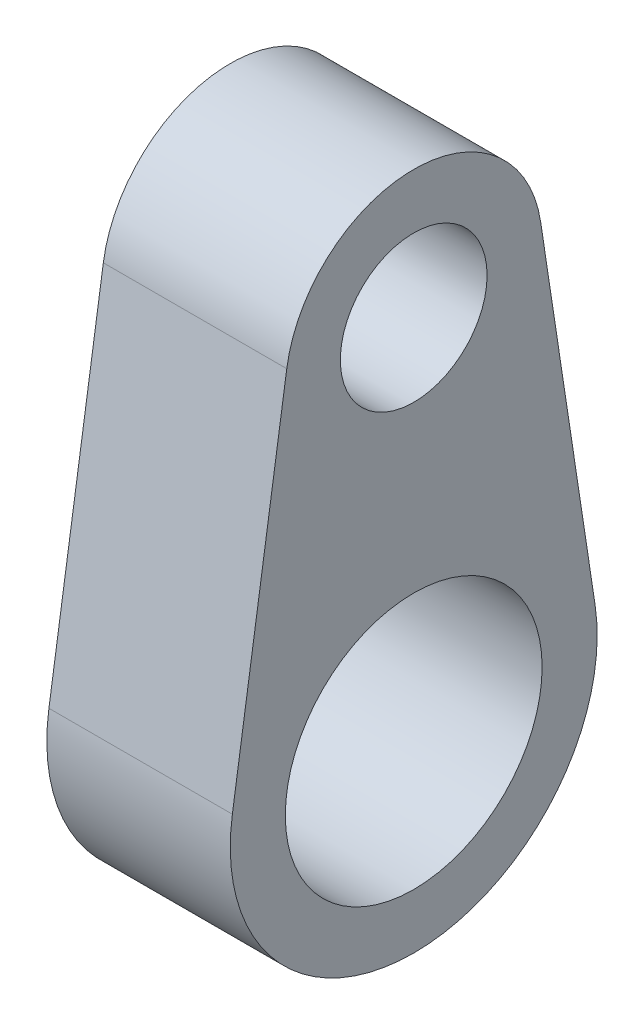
ISO-10303-21;
HEADER;
FILE_DESCRIPTION(('STEP AP214'),'2;1');
FILE_NAME('part.step','',(''),(''),'','','');
FILE_SCHEMA(('AUTOMOTIVE_DESIGN { 1 0 10303 214 1 1 1 1 }'));
ENDSEC;
DATA;
#1=APPLICATION_CONTEXT('core data for automotive mechanical design processes');
#2=APPLICATION_PROTOCOL_DEFINITION('international standard','automotive_design',2000,#1);
#3=PRODUCT_CONTEXT('',#1,'mechanical');
#4=PRODUCT('Part','Part','',(#3));
#5=PRODUCT_RELATED_PRODUCT_CATEGORY('part','',(#4));
#6=PRODUCT_DEFINITION_FORMATION('','',#4);
#7=PRODUCT_DEFINITION_CONTEXT('part definition',#1,'design');
#8=PRODUCT_DEFINITION('design','',#6,#7);
#9=PRODUCT_DEFINITION_SHAPE('','',#8);
#10=(LENGTH_UNIT() NAMED_UNIT(*) SI_UNIT(.MILLI.,.METRE.));
#11=(NAMED_UNIT(*) PLANE_ANGLE_UNIT() SI_UNIT($,.RADIAN.));
#12=(NAMED_UNIT(*) SI_UNIT($,.STERADIAN.) SOLID_ANGLE_UNIT());
#13=UNCERTAINTY_MEASURE_WITH_UNIT(LENGTH_MEASURE(1.E-05),#10,'distance_accuracy_value','');
#14=(GEOMETRIC_REPRESENTATION_CONTEXT(3) GLOBAL_UNCERTAINTY_ASSIGNED_CONTEXT((#13)) GLOBAL_UNIT_ASSIGNED_CONTEXT((#10,
#11,#12)) REPRESENTATION_CONTEXT('',''));
#15=CARTESIAN_POINT('',(0.,0.,0.));
#16=DIRECTION('',(0.,0.,1.));
#17=DIRECTION('',(1.,0.,0.));
#18=AXIS2_PLACEMENT_3D('',#15,#16,#17);
#19=CARTESIAN_POINT('',(12.5,2.625,-17.3020049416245));
#20=DIRECTION('',(0.,0.15,-0.988685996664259));
#21=DIRECTION('',(0.,0.988685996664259,0.15));
#22=AXIS2_PLACEMENT_3D('',#19,#20,#21);
#23=PLANE('',#22);
#24=DIRECTION('',(0.,-0.988685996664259,-0.15));
#25=VECTOR('',#24,1.);
#26=CARTESIAN_POINT('',(-12.5,2.625,-17.3020049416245));
#27=LINE('',#26,#25);
#28=CARTESIAN_POINT('',(-12.5,2.625,-17.3020049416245));
#29=VERTEX_POINT('',#28);
#30=CARTESIAN_POINT('',(-12.5,-46.25,-24.7171499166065));
#31=VERTEX_POINT('',#30);
#32=EDGE_CURVE('E115',#29,#31,#27,.T.);
#33=ORIENTED_EDGE('',*,*,#32,.F.);
#34=DIRECTION('',(-1.,0.,0.));
#35=VECTOR('',#34,1.);
#36=CARTESIAN_POINT('',(12.5,2.625,-17.3020049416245));
#37=LINE('',#36,#35);
#38=CARTESIAN_POINT('',(12.5,2.625,-17.3020049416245));
#39=VERTEX_POINT('',#38);
#40=EDGE_CURVE('E11',#39,#29,#37,.T.);
#41=ORIENTED_EDGE('',*,*,#40,.F.);
#42=DIRECTION('',(0.,-0.988685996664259,-0.15));
#43=VECTOR('',#42,1.);
#44=CARTESIAN_POINT('',(12.5,2.625,-17.3020049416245));
#45=LINE('',#44,#43);
#46=CARTESIAN_POINT('',(12.5,-46.25,-24.7171499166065));
#47=VERTEX_POINT('',#46);
#48=EDGE_CURVE('E97',#39,#47,#45,.T.);
#49=ORIENTED_EDGE('',*,*,#48,.T.);
#50=DIRECTION('',(-1.,0.,0.));
#51=VECTOR('',#50,1.);
#52=CARTESIAN_POINT('',(12.5,-46.25,-24.7171499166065));
#53=LINE('',#52,#51);
#54=EDGE_CURVE('E78',#47,#31,#53,.T.);
#55=ORIENTED_EDGE('',*,*,#54,.T.);
#56=EDGE_LOOP('',(#33,#41,#49,#55));
#57=FACE_BOUND('',#56,.T.);
#58=ADVANCED_FACE('F39',(#57),#23,.T.);
#59=CARTESIAN_POINT('',(12.5,0.,0.));
#60=DIRECTION('',(-1.,0.,0.));
#61=DIRECTION('',(0.,0.,1.));
#62=AXIS2_PLACEMENT_3D('',#59,#60,#61);
#63=CYLINDRICAL_SURFACE('',#62,17.5);
#64=CARTESIAN_POINT('',(-12.5,0.,0.));
#65=DIRECTION('',(1.,0.,0.));
#66=DIRECTION('',(0.,0.,-1.));
#67=AXIS2_PLACEMENT_3D('',#64,#65,#66);
#68=CIRCLE('',#67,17.5);
#69=CARTESIAN_POINT('',(-12.5,2.625,17.3020049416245));
#70=VERTEX_POINT('',#69);
#71=EDGE_CURVE('E102',#29,#70,#68,.T.);
#72=ORIENTED_EDGE('',*,*,#71,.T.);
#73=DIRECTION('',(-1.,0.,0.));
#74=VECTOR('',#73,1.);
#75=CARTESIAN_POINT('',(12.5,2.625,17.3020049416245));
#76=LINE('',#75,#74);
#77=CARTESIAN_POINT('',(12.5,2.625,17.3020049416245));
#78=VERTEX_POINT('',#77);
#79=EDGE_CURVE('E48',#78,#70,#76,.T.);
#80=ORIENTED_EDGE('',*,*,#79,.F.);
#81=CARTESIAN_POINT('',(12.5,0.,0.));
#82=DIRECTION('',(1.,0.,0.));
#83=DIRECTION('',(0.,0.,-1.));
#84=AXIS2_PLACEMENT_3D('',#81,#82,#83);
#85=CIRCLE('',#84,17.5);
#86=EDGE_CURVE('E93',#39,#78,#85,.T.);
#87=ORIENTED_EDGE('',*,*,#86,.F.);
#88=ORIENTED_EDGE('',*,*,#40,.T.);
#89=EDGE_LOOP('',(#72,#80,#87,#88));
#90=FACE_BOUND('',#89,.T.);
#91=ADVANCED_FACE('F100',(#90),#63,.T.);
#92=CARTESIAN_POINT('',(12.5,2.625,17.3020049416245));
#93=DIRECTION('',(0.,-0.15,-0.988685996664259));
#94=DIRECTION('',(0.,0.98868599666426,-0.15));
#95=AXIS2_PLACEMENT_3D('',#92,#93,#94);
#96=PLANE('',#95);
#97=DIRECTION('',(0.,-0.98868599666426,0.15));
#98=VECTOR('',#97,1.);
#99=CARTESIAN_POINT('',(-12.5,2.625,17.3020049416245));
#100=LINE('',#99,#98);
#101=CARTESIAN_POINT('',(-12.5,-46.25,24.7171499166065));
#102=VERTEX_POINT('',#101);
#103=EDGE_CURVE('E112',#70,#102,#100,.T.);
#104=ORIENTED_EDGE('',*,*,#103,.T.);
#105=DIRECTION('',(-1.,0.,0.));
#106=VECTOR('',#105,1.);
#107=CARTESIAN_POINT('',(12.5,-46.25,24.7171499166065));
#108=LINE('',#107,#106);
#109=CARTESIAN_POINT('',(12.5,-46.25,24.7171499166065));
#110=VERTEX_POINT('',#109);
#111=EDGE_CURVE('E92',#110,#102,#108,.T.);
#112=ORIENTED_EDGE('',*,*,#111,.F.);
#113=DIRECTION('',(0.,-0.98868599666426,0.15));
#114=VECTOR('',#113,1.);
#115=CARTESIAN_POINT('',(12.5,2.625,17.3020049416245));
#116=LINE('',#115,#114);
#117=EDGE_CURVE('E86',#78,#110,#116,.T.);
#118=ORIENTED_EDGE('',*,*,#117,.F.);
#119=ORIENTED_EDGE('',*,*,#79,.T.);
#120=EDGE_LOOP('',(#104,#112,#118,#119));
#121=FACE_BOUND('',#120,.T.);
#122=ADVANCED_FACE('F89',(#121),#96,.F.);
#123=CARTESIAN_POINT('',(12.5,-50.,0.));
#124=DIRECTION('',(-1.,0.,0.));
#125=DIRECTION('',(0.,0.,1.));
#126=AXIS2_PLACEMENT_3D('',#123,#124,#125);
#127=CYLINDRICAL_SURFACE('',#126,25.);
#128=CARTESIAN_POINT('',(-12.5,-50.,0.));
#129=DIRECTION('',(1.,0.,0.));
#130=DIRECTION('',(0.,0.,-1.));
#131=AXIS2_PLACEMENT_3D('',#128,#129,#130);
#132=CIRCLE('',#131,25.);
#133=EDGE_CURVE('E71',#102,#31,#132,.T.);
#134=ORIENTED_EDGE('',*,*,#133,.T.);
#135=ORIENTED_EDGE('',*,*,#54,.F.);
#136=CARTESIAN_POINT('',(12.5,-50.,0.));
#137=DIRECTION('',(1.,0.,0.));
#138=DIRECTION('',(0.,0.,-1.));
#139=AXIS2_PLACEMENT_3D('',#136,#137,#138);
#140=CIRCLE('',#139,25.);
#141=EDGE_CURVE('E56',#110,#47,#140,.T.);
#142=ORIENTED_EDGE('',*,*,#141,.F.);
#143=ORIENTED_EDGE('',*,*,#111,.T.);
#144=EDGE_LOOP('',(#134,#135,#142,#143));
#145=FACE_BOUND('',#144,.T.);
#146=ADVANCED_FACE('F149',(#145),#127,.T.);
#147=CARTESIAN_POINT('',(12.5,0.,0.));
#148=DIRECTION('',(-1.,0.,0.));
#149=DIRECTION('',(0.,0.,1.));
#150=AXIS2_PLACEMENT_3D('',#147,#148,#149);
#151=CYLINDRICAL_SURFACE('',#150,10.);
#152=CARTESIAN_POINT('',(12.5,0.,0.));
#153=DIRECTION('',(1.,0.,0.));
#154=DIRECTION('',(0.,0.,-1.));
#155=AXIS2_PLACEMENT_3D('',#152,#153,#154);
#156=CIRCLE('',#155,10.);
#157=CARTESIAN_POINT('',(12.5,0.,-10.));
#158=VERTEX_POINT('',#157);
#159=EDGE_CURVE('E110',#158,#158,#156,.T.);
#160=ORIENTED_EDGE('',*,*,#159,.T.);
#161=EDGE_LOOP('',(#160));
#162=FACE_BOUND('',#161,.T.);
#163=CARTESIAN_POINT('',(-12.5,0.,0.));
#164=DIRECTION('',(1.,0.,0.));
#165=DIRECTION('',(0.,0.,-1.));
#166=AXIS2_PLACEMENT_3D('',#163,#164,#165);
#167=CIRCLE('',#166,10.);
#168=CARTESIAN_POINT('',(-12.5,0.,-10.));
#169=VERTEX_POINT('',#168);
#170=EDGE_CURVE('E117',#169,#169,#167,.T.);
#171=ORIENTED_EDGE('',*,*,#170,.F.);
#172=EDGE_LOOP('',(#171));
#173=FACE_BOUND('',#172,.T.);
#174=ADVANCED_FACE('F41',(#162,#173),#151,.F.);
#175=CARTESIAN_POINT('',(12.5,-50.,0.));
#176=DIRECTION('',(-1.,0.,0.));
#177=DIRECTION('',(0.,0.,1.));
#178=AXIS2_PLACEMENT_3D('',#175,#176,#177);
#179=CYLINDRICAL_SURFACE('',#178,17.5);
#180=CARTESIAN_POINT('',(12.5,-50.,0.));
#181=DIRECTION('',(1.,0.,0.));
#182=DIRECTION('',(0.,0.,-1.));
#183=AXIS2_PLACEMENT_3D('',#180,#181,#182);
#184=CIRCLE('',#183,17.5);
#185=CARTESIAN_POINT('',(12.5,-50.,-17.5));
#186=VERTEX_POINT('',#185);
#187=EDGE_CURVE('E106',#186,#186,#184,.T.);
#188=ORIENTED_EDGE('',*,*,#187,.T.);
#189=EDGE_LOOP('',(#188));
#190=FACE_BOUND('',#189,.T.);
#191=CARTESIAN_POINT('',(-12.5,-50.,0.));
#192=DIRECTION('',(1.,0.,0.));
#193=DIRECTION('',(0.,0.,-1.));
#194=AXIS2_PLACEMENT_3D('',#191,#192,#193);
#195=CIRCLE('',#194,17.5);
#196=CARTESIAN_POINT('',(-12.5,-50.,-17.5));
#197=VERTEX_POINT('',#196);
#198=EDGE_CURVE('E107',#197,#197,#195,.T.);
#199=ORIENTED_EDGE('',*,*,#198,.F.);
#200=EDGE_LOOP('',(#199));
#201=FACE_BOUND('',#200,.T.);
#202=ADVANCED_FACE('F131',(#190,#201),#179,.F.);
#203=CARTESIAN_POINT('',(12.5,0.,0.));
#204=DIRECTION('',(1.,0.,0.));
#205=DIRECTION('',(0.,0.,-1.));
#206=AXIS2_PLACEMENT_3D('',#203,#204,#205);
#207=PLANE('',#206);
#208=ORIENTED_EDGE('',*,*,#159,.F.);
#209=EDGE_LOOP('',(#208));
#210=FACE_BOUND('',#209,.T.);
#211=ORIENTED_EDGE('',*,*,#48,.F.);
#212=ORIENTED_EDGE('',*,*,#86,.T.);
#213=ORIENTED_EDGE('',*,*,#117,.T.);
#214=ORIENTED_EDGE('',*,*,#141,.T.);
#215=EDGE_LOOP('',(#211,#212,#213,#214));
#216=FACE_BOUND('',#215,.T.);
#217=ORIENTED_EDGE('',*,*,#187,.F.);
#218=EDGE_LOOP('',(#217));
#219=FACE_BOUND('',#218,.T.);
#220=ADVANCED_FACE('F95',(#210,#216,#219),#207,.T.);
#221=CARTESIAN_POINT('',(-12.5,0.,0.));
#222=DIRECTION('',(1.,0.,0.));
#223=DIRECTION('',(0.,0.,-1.));
#224=AXIS2_PLACEMENT_3D('',#221,#222,#223);
#225=PLANE('',#224);
#226=ORIENTED_EDGE('',*,*,#170,.T.);
#227=EDGE_LOOP('',(#226));
#228=FACE_BOUND('',#227,.T.);
#229=ORIENTED_EDGE('',*,*,#32,.T.);
#230=ORIENTED_EDGE('',*,*,#133,.F.);
#231=ORIENTED_EDGE('',*,*,#103,.F.);
#232=ORIENTED_EDGE('',*,*,#71,.F.);
#233=EDGE_LOOP('',(#229,#230,#231,#232));
#234=FACE_BOUND('',#233,.T.);
#235=ORIENTED_EDGE('',*,*,#198,.T.);
#236=EDGE_LOOP('',(#235));
#237=FACE_BOUND('',#236,.T.);
#238=ADVANCED_FACE('F130',(#228,#234,#237),#225,.F.);
#239=CLOSED_SHELL('',(#58,#91,#122,#146,#174,#202,#220,#238));
#240=MANIFOLD_SOLID_BREP('B2',#239);
#241=ADVANCED_BREP_SHAPE_REPRESENTATION('',(#18,#240),#14);
#242=SHAPE_DEFINITION_REPRESENTATION(#9,#241);
ENDSEC;
END-ISO-10303-21;
